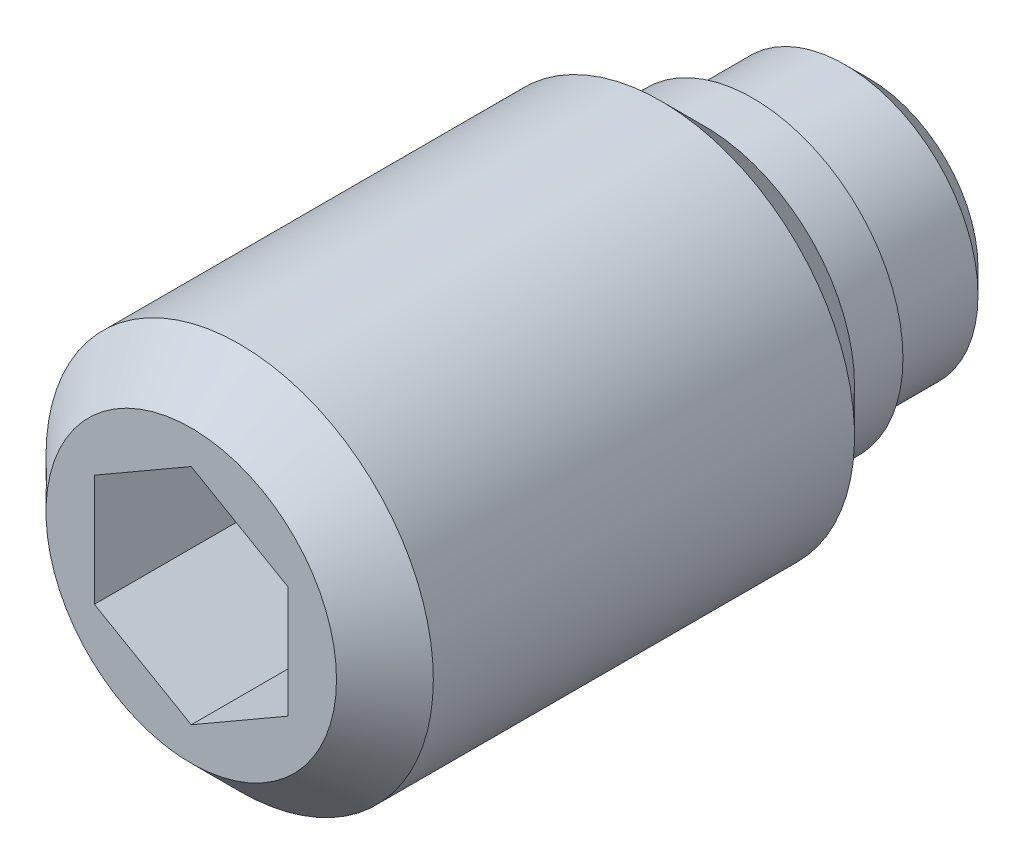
ISO-10303-21;
HEADER;
FILE_DESCRIPTION(('STEP AP214'),'2;1');
FILE_NAME('part.step','',(''),(''),'','','');
FILE_SCHEMA(('AUTOMOTIVE_DESIGN { 1 0 10303 214 1 1 1 1 }'));
ENDSEC;
DATA;
#1=APPLICATION_CONTEXT('core data for automotive mechanical design processes');
#2=APPLICATION_PROTOCOL_DEFINITION('international standard','automotive_design',2000,#1);
#3=PRODUCT_CONTEXT('',#1,'mechanical');
#4=PRODUCT('Part','Part','',(#3));
#5=PRODUCT_RELATED_PRODUCT_CATEGORY('part','',(#4));
#6=PRODUCT_DEFINITION_FORMATION('','',#4);
#7=PRODUCT_DEFINITION_CONTEXT('part definition',#1,'design');
#8=PRODUCT_DEFINITION('design','',#6,#7);
#9=PRODUCT_DEFINITION_SHAPE('','',#8);
#10=(LENGTH_UNIT() NAMED_UNIT(*) SI_UNIT(.MILLI.,.METRE.));
#11=(NAMED_UNIT(*) PLANE_ANGLE_UNIT() SI_UNIT($,.RADIAN.));
#12=(NAMED_UNIT(*) SI_UNIT($,.STERADIAN.) SOLID_ANGLE_UNIT());
#13=UNCERTAINTY_MEASURE_WITH_UNIT(LENGTH_MEASURE(1.E-05),#10,'distance_accuracy_value','');
#14=(GEOMETRIC_REPRESENTATION_CONTEXT(3) GLOBAL_UNCERTAINTY_ASSIGNED_CONTEXT((#13)) GLOBAL_UNIT_ASSIGNED_CONTEXT((#10,
#11,#12)) REPRESENTATION_CONTEXT('',''));
#15=CARTESIAN_POINT('',(0.,0.,0.));
#16=DIRECTION('',(0.,0.,1.));
#17=DIRECTION('',(1.,0.,0.));
#18=AXIS2_PLACEMENT_3D('',#15,#16,#17);
#19=CARTESIAN_POINT('',(0.,0.,2.4));
#20=DIRECTION('',(0.,0.,-1.));
#21=DIRECTION('',(-1.,0.,0.));
#22=AXIS2_PLACEMENT_3D('',#19,#20,#21);
#23=CYLINDRICAL_SURFACE('',#22,4.);
#24=CARTESIAN_POINT('',(0.,0.,13.));
#25=DIRECTION('',(0.,0.,1.));
#26=DIRECTION('',(1.,0.,0.));
#27=AXIS2_PLACEMENT_3D('',#24,#25,#26);
#28=CIRCLE('',#27,4.);
#29=CARTESIAN_POINT('',(4.,0.,13.));
#30=VERTEX_POINT('',#29);
#31=EDGE_CURVE('E9',#30,#30,#28,.F.);
#32=ORIENTED_EDGE('',*,*,#31,.T.);
#33=EDGE_LOOP('',(#32));
#34=FACE_BOUND('',#33,.T.);
#35=CARTESIAN_POINT('',(0.,0.,4.3));
#36=DIRECTION('',(0.,0.,-1.));
#37=DIRECTION('',(-1.,0.,0.));
#38=AXIS2_PLACEMENT_3D('',#35,#36,#37);
#39=CIRCLE('',#38,4.);
#40=CARTESIAN_POINT('',(-4.,0.,4.3));
#41=VERTEX_POINT('',#40);
#42=EDGE_CURVE('E136',#41,#41,#39,.T.);
#43=ORIENTED_EDGE('',*,*,#42,.F.);
#44=EDGE_LOOP('',(#43));
#45=FACE_BOUND('',#44,.T.);
#46=ADVANCED_FACE('F14',(#34,#45),#23,.T.);
#47=CARTESIAN_POINT('',(0.,0.,4.3));
#48=DIRECTION('',(0.,0.,1.));
#49=DIRECTION('',(1.,0.,0.));
#50=AXIS2_PLACEMENT_3D('',#47,#48,#49);
#51=CONICAL_SURFACE('',#50,4.,0.785398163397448);
#52=ORIENTED_EDGE('',*,*,#42,.T.);
#53=EDGE_LOOP('',(#52));
#54=FACE_BOUND('',#53,.T.);
#55=CARTESIAN_POINT('',(0.,0.,3.4));
#56=DIRECTION('',(0.,0.,-1.));
#57=DIRECTION('',(-1.,0.,0.));
#58=AXIS2_PLACEMENT_3D('',#55,#56,#57);
#59=CIRCLE('',#58,3.1);
#60=CARTESIAN_POINT('',(-3.1,0.,3.4));
#61=VERTEX_POINT('',#60);
#62=EDGE_CURVE('E133',#61,#61,#59,.T.);
#63=ORIENTED_EDGE('',*,*,#62,.F.);
#64=EDGE_LOOP('',(#63));
#65=FACE_BOUND('',#64,.T.);
#66=ADVANCED_FACE('F158',(#54,#65),#51,.T.);
#67=CARTESIAN_POINT('',(0.,0.,2.4));
#68=DIRECTION('',(0.,0.,-1.));
#69=DIRECTION('',(-1.,0.,0.));
#70=AXIS2_PLACEMENT_3D('',#67,#68,#69);
#71=CYLINDRICAL_SURFACE('',#70,3.1);
#72=ORIENTED_EDGE('',*,*,#62,.T.);
#73=EDGE_LOOP('',(#72));
#74=FACE_BOUND('',#73,.T.);
#75=CARTESIAN_POINT('',(0.,0.,2.4));
#76=DIRECTION('',(0.,0.,-1.));
#77=DIRECTION('',(-1.,0.,0.));
#78=AXIS2_PLACEMENT_3D('',#75,#76,#77);
#79=CIRCLE('',#78,3.1);
#80=CARTESIAN_POINT('',(-3.1,0.,2.4));
#81=VERTEX_POINT('',#80);
#82=EDGE_CURVE('E130',#81,#81,#79,.T.);
#83=ORIENTED_EDGE('',*,*,#82,.F.);
#84=EDGE_LOOP('',(#83));
#85=FACE_BOUND('',#84,.T.);
#86=ADVANCED_FACE('F163',(#74,#85),#71,.T.);
#87=CARTESIAN_POINT('',(0.,3.1,2.4));
#88=DIRECTION('',(0.,0.,1.));
#89=DIRECTION('',(1.,0.,0.));
#90=AXIS2_PLACEMENT_3D('',#87,#88,#89);
#91=PLANE('',#90);
#92=ORIENTED_EDGE('',*,*,#82,.T.);
#93=EDGE_LOOP('',(#92));
#94=FACE_BOUND('',#93,.T.);
#95=CARTESIAN_POINT('',(0.,0.,2.4));
#96=DIRECTION('',(0.,0.,-1.));
#97=DIRECTION('',(-1.,0.,0.));
#98=AXIS2_PLACEMENT_3D('',#95,#96,#97);
#99=CIRCLE('',#98,2.75);
#100=CARTESIAN_POINT('',(-2.75,0.,2.4));
#101=VERTEX_POINT('',#100);
#102=EDGE_CURVE('E127',#101,#101,#99,.T.);
#103=ORIENTED_EDGE('',*,*,#102,.F.);
#104=EDGE_LOOP('',(#103));
#105=FACE_BOUND('',#104,.T.);
#106=ADVANCED_FACE('F170',(#94,#105),#91,.F.);
#107=CARTESIAN_POINT('',(0.,0.,0.));
#108=DIRECTION('',(0.,0.,-1.));
#109=DIRECTION('',(-1.,0.,0.));
#110=AXIS2_PLACEMENT_3D('',#107,#108,#109);
#111=CYLINDRICAL_SURFACE('',#110,2.75);
#112=CARTESIAN_POINT('',(0.,0.,0.5));
#113=DIRECTION('',(0.,0.,-1.));
#114=DIRECTION('',(-1.,0.,0.));
#115=AXIS2_PLACEMENT_3D('',#112,#113,#114);
#116=CIRCLE('',#115,2.75);
#117=CARTESIAN_POINT('',(-2.75,0.,0.5));
#118=VERTEX_POINT('',#117);
#119=EDGE_CURVE('E124',#118,#118,#116,.T.);
#120=ORIENTED_EDGE('',*,*,#119,.F.);
#121=EDGE_LOOP('',(#120));
#122=FACE_BOUND('',#121,.T.);
#123=ORIENTED_EDGE('',*,*,#102,.T.);
#124=EDGE_LOOP('',(#123));
#125=FACE_BOUND('',#124,.T.);
#126=ADVANCED_FACE('F174',(#122,#125),#111,.T.);
#127=CARTESIAN_POINT('',(0.,0.,0.5));
#128=DIRECTION('',(0.,0.,1.));
#129=DIRECTION('',(1.,0.,0.));
#130=AXIS2_PLACEMENT_3D('',#127,#128,#129);
#131=CONICAL_SURFACE('',#130,2.75,0.785398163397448);
#132=CARTESIAN_POINT('',(0.,0.,0.));
#133=DIRECTION('',(0.,0.,-1.));
#134=DIRECTION('',(-1.,0.,0.));
#135=AXIS2_PLACEMENT_3D('',#132,#133,#134);
#136=CIRCLE('',#135,2.25);
#137=CARTESIAN_POINT('',(-2.25,0.,0.));
#138=VERTEX_POINT('',#137);
#139=EDGE_CURVE('E116',#138,#138,#136,.T.);
#140=ORIENTED_EDGE('',*,*,#139,.F.);
#141=EDGE_LOOP('',(#140));
#142=FACE_BOUND('',#141,.T.);
#143=ORIENTED_EDGE('',*,*,#119,.T.);
#144=EDGE_LOOP('',(#143));
#145=FACE_BOUND('',#144,.T.);
#146=ADVANCED_FACE('F178',(#142,#145),#131,.T.);
#147=CARTESIAN_POINT('',(0.,2.25,0.));
#148=DIRECTION('',(0.,0.,1.));
#149=DIRECTION('',(1.,0.,0.));
#150=AXIS2_PLACEMENT_3D('',#147,#148,#149);
#151=PLANE('',#150);
#152=ORIENTED_EDGE('',*,*,#139,.T.);
#153=EDGE_LOOP('',(#152));
#154=FACE_BOUND('',#153,.T.);
#155=ADVANCED_FACE('F153',(#154),#151,.F.);
#156=CARTESIAN_POINT('',(0.,0.,14.));
#157=DIRECTION('',(0.,0.,1.));
#158=DIRECTION('',(1.,0.,0.));
#159=AXIS2_PLACEMENT_3D('',#156,#157,#158);
#160=PLANE('',#159);
#161=DIRECTION('',(0.866025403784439,-0.5,0.));
#162=VECTOR('',#161,1.);
#163=CARTESIAN_POINT('',(-2.,-1.15470053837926,14.));
#164=LINE('',#163,#162);
#165=CARTESIAN_POINT('',(-2.,-1.15470053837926,14.));
#166=VERTEX_POINT('',#165);
#167=CARTESIAN_POINT('',(0.,-2.30940107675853,14.));
#168=VERTEX_POINT('',#167);
#169=EDGE_CURVE('E29',#166,#168,#164,.T.);
#170=ORIENTED_EDGE('',*,*,#169,.F.);
#171=DIRECTION('',(0.,-1.,0.));
#172=VECTOR('',#171,1.);
#173=CARTESIAN_POINT('',(-2.,1.15470053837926,14.));
#174=LINE('',#173,#172);
#175=CARTESIAN_POINT('',(-2.,1.15470053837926,14.));
#176=VERTEX_POINT('',#175);
#177=EDGE_CURVE('E112',#176,#166,#174,.T.);
#178=ORIENTED_EDGE('',*,*,#177,.F.);
#179=DIRECTION('',(-0.866025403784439,-0.5,0.));
#180=VECTOR('',#179,1.);
#181=CARTESIAN_POINT('',(0.,2.30940107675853,14.));
#182=LINE('',#181,#180);
#183=CARTESIAN_POINT('',(0.,2.30940107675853,14.));
#184=VERTEX_POINT('',#183);
#185=EDGE_CURVE('E110',#184,#176,#182,.T.);
#186=ORIENTED_EDGE('',*,*,#185,.F.);
#187=DIRECTION('',(-0.866025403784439,0.5,0.));
#188=VECTOR('',#187,1.);
#189=CARTESIAN_POINT('',(2.,1.15470053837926,14.));
#190=LINE('',#189,#188);
#191=CARTESIAN_POINT('',(2.,1.15470053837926,14.));
#192=VERTEX_POINT('',#191);
#193=EDGE_CURVE('E77',#192,#184,#190,.T.);
#194=ORIENTED_EDGE('',*,*,#193,.F.);
#195=DIRECTION('',(0.,1.,0.));
#196=VECTOR('',#195,1.);
#197=CARTESIAN_POINT('',(2.,-1.15470053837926,14.));
#198=LINE('',#197,#196);
#199=CARTESIAN_POINT('',(2.,-1.15470053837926,14.));
#200=VERTEX_POINT('',#199);
#201=EDGE_CURVE('E106',#200,#192,#198,.T.);
#202=ORIENTED_EDGE('',*,*,#201,.F.);
#203=DIRECTION('',(0.866025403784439,0.5,0.));
#204=VECTOR('',#203,1.);
#205=CARTESIAN_POINT('',(0.,-2.30940107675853,14.));
#206=LINE('',#205,#204);
#207=EDGE_CURVE('E103',#168,#200,#206,.T.);
#208=ORIENTED_EDGE('',*,*,#207,.F.);
#209=EDGE_LOOP('',(#170,#178,#186,#194,#202,#208));
#210=FACE_BOUND('',#209,.T.);
#211=CARTESIAN_POINT('',(0.,0.,14.));
#212=DIRECTION('',(0.,0.,1.));
#213=DIRECTION('',(1.,0.,0.));
#214=AXIS2_PLACEMENT_3D('',#211,#212,#213);
#215=CIRCLE('',#214,3.);
#216=CARTESIAN_POINT('',(3.,0.,14.));
#217=VERTEX_POINT('',#216);
#218=EDGE_CURVE('E22',#217,#217,#215,.T.);
#219=ORIENTED_EDGE('',*,*,#218,.T.);
#220=EDGE_LOOP('',(#219));
#221=FACE_BOUND('',#220,.T.);
#222=ADVANCED_FACE('F141',(#210,#221),#160,.T.);
#223=CARTESIAN_POINT('',(0.,0.,14.));
#224=DIRECTION('',(0.,0.,-1.));
#225=DIRECTION('',(-1.,0.,0.));
#226=AXIS2_PLACEMENT_3D('',#223,#224,#225);
#227=CONICAL_SURFACE('',#226,3.,0.785398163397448);
#228=ORIENTED_EDGE('',*,*,#31,.F.);
#229=EDGE_LOOP('',(#228));
#230=FACE_BOUND('',#229,.T.);
#231=ORIENTED_EDGE('',*,*,#218,.F.);
#232=EDGE_LOOP('',(#231));
#233=FACE_BOUND('',#232,.T.);
#234=ADVANCED_FACE('F16',(#230,#233),#227,.T.);
#235=CARTESIAN_POINT('',(-2.,-1.15470053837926,11.));
#236=DIRECTION('',(-0.5,-0.866025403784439,0.));
#237=DIRECTION('',(0.866025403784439,-0.5,0.));
#238=AXIS2_PLACEMENT_3D('',#235,#236,#237);
#239=PLANE('',#238);
#240=ORIENTED_EDGE('',*,*,#169,.T.);
#241=DIRECTION('',(0.,0.,1.));
#242=VECTOR('',#241,1.);
#243=CARTESIAN_POINT('',(0.,-2.30940107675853,11.));
#244=LINE('',#243,#242);
#245=CARTESIAN_POINT('',(0.,-2.30940107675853,11.));
#246=VERTEX_POINT('',#245);
#247=EDGE_CURVE('E59',#246,#168,#244,.T.);
#248=ORIENTED_EDGE('',*,*,#247,.F.);
#249=DIRECTION('',(0.866025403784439,-0.5,0.));
#250=VECTOR('',#249,1.);
#251=CARTESIAN_POINT('',(-2.,-1.15470053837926,11.));
#252=LINE('',#251,#250);
#253=CARTESIAN_POINT('',(-2.,-1.15470053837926,11.));
#254=VERTEX_POINT('',#253);
#255=EDGE_CURVE('E114',#254,#246,#252,.T.);
#256=ORIENTED_EDGE('',*,*,#255,.F.);
#257=DIRECTION('',(0.,0.,1.));
#258=VECTOR('',#257,1.);
#259=CARTESIAN_POINT('',(-2.,-1.15470053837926,11.));
#260=LINE('',#259,#258);
#261=EDGE_CURVE('E37',#254,#166,#260,.T.);
#262=ORIENTED_EDGE('',*,*,#261,.T.);
#263=EDGE_LOOP('',(#240,#248,#256,#262));
#264=FACE_BOUND('',#263,.T.);
#265=ADVANCED_FACE('F144',(#264),#239,.F.);
#266=CARTESIAN_POINT('',(-2.,1.15470053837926,11.));
#267=DIRECTION('',(-1.,0.,0.));
#268=DIRECTION('',(0.,0.,1.));
#269=AXIS2_PLACEMENT_3D('',#266,#267,#268);
#270=PLANE('',#269);
#271=ORIENTED_EDGE('',*,*,#177,.T.);
#272=ORIENTED_EDGE('',*,*,#261,.F.);
#273=DIRECTION('',(0.,-1.,0.));
#274=VECTOR('',#273,1.);
#275=CARTESIAN_POINT('',(-2.,1.15470053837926,11.));
#276=LINE('',#275,#274);
#277=CARTESIAN_POINT('',(-2.,1.15470053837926,11.));
#278=VERTEX_POINT('',#277);
#279=EDGE_CURVE('E89',#278,#254,#276,.T.);
#280=ORIENTED_EDGE('',*,*,#279,.F.);
#281=DIRECTION('',(0.,0.,1.));
#282=VECTOR('',#281,1.);
#283=CARTESIAN_POINT('',(-2.,1.15470053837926,11.));
#284=LINE('',#283,#282);
#285=EDGE_CURVE('E81',#278,#176,#284,.T.);
#286=ORIENTED_EDGE('',*,*,#285,.T.);
#287=EDGE_LOOP('',(#271,#272,#280,#286));
#288=FACE_BOUND('',#287,.T.);
#289=ADVANCED_FACE('F151',(#288),#270,.F.);
#290=CARTESIAN_POINT('',(0.,2.30940107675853,11.));
#291=DIRECTION('',(-0.5,0.866025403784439,0.));
#292=DIRECTION('',(-0.866025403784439,-0.5,0.));
#293=AXIS2_PLACEMENT_3D('',#290,#291,#292);
#294=PLANE('',#293);
#295=ORIENTED_EDGE('',*,*,#185,.T.);
#296=ORIENTED_EDGE('',*,*,#285,.F.);
#297=DIRECTION('',(-0.866025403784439,-0.5,0.));
#298=VECTOR('',#297,1.);
#299=CARTESIAN_POINT('',(0.,2.30940107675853,11.));
#300=LINE('',#299,#298);
#301=CARTESIAN_POINT('',(0.,2.30940107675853,11.));
#302=VERTEX_POINT('',#301);
#303=EDGE_CURVE('E85',#302,#278,#300,.T.);
#304=ORIENTED_EDGE('',*,*,#303,.F.);
#305=DIRECTION('',(0.,0.,1.));
#306=VECTOR('',#305,1.);
#307=CARTESIAN_POINT('',(0.,2.30940107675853,11.));
#308=LINE('',#307,#306);
#309=EDGE_CURVE('E70',#302,#184,#308,.T.);
#310=ORIENTED_EDGE('',*,*,#309,.T.);
#311=EDGE_LOOP('',(#295,#296,#304,#310));
#312=FACE_BOUND('',#311,.T.);
#313=ADVANCED_FACE('F86',(#312),#294,.F.);
#314=CARTESIAN_POINT('',(2.,1.15470053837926,11.));
#315=DIRECTION('',(0.5,0.866025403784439,0.));
#316=DIRECTION('',(-0.866025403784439,0.5,0.));
#317=AXIS2_PLACEMENT_3D('',#314,#315,#316);
#318=PLANE('',#317);
#319=ORIENTED_EDGE('',*,*,#193,.T.);
#320=ORIENTED_EDGE('',*,*,#309,.F.);
#321=DIRECTION('',(-0.866025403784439,0.5,0.));
#322=VECTOR('',#321,1.);
#323=CARTESIAN_POINT('',(2.,1.15470053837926,11.));
#324=LINE('',#323,#322);
#325=CARTESIAN_POINT('',(2.,1.15470053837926,11.));
#326=VERTEX_POINT('',#325);
#327=EDGE_CURVE('E74',#326,#302,#324,.T.);
#328=ORIENTED_EDGE('',*,*,#327,.F.);
#329=DIRECTION('',(0.,0.,1.));
#330=VECTOR('',#329,1.);
#331=CARTESIAN_POINT('',(2.,1.15470053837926,11.));
#332=LINE('',#331,#330);
#333=EDGE_CURVE('E82',#326,#192,#332,.T.);
#334=ORIENTED_EDGE('',*,*,#333,.T.);
#335=EDGE_LOOP('',(#319,#320,#328,#334));
#336=FACE_BOUND('',#335,.T.);
#337=ADVANCED_FACE('F72',(#336),#318,.F.);
#338=CARTESIAN_POINT('',(2.,-1.15470053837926,11.));
#339=DIRECTION('',(1.,0.,0.));
#340=DIRECTION('',(0.,0.,-1.));
#341=AXIS2_PLACEMENT_3D('',#338,#339,#340);
#342=PLANE('',#341);
#343=ORIENTED_EDGE('',*,*,#201,.T.);
#344=ORIENTED_EDGE('',*,*,#333,.F.);
#345=DIRECTION('',(0.,1.,0.));
#346=VECTOR('',#345,1.);
#347=CARTESIAN_POINT('',(2.,-1.15470053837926,11.));
#348=LINE('',#347,#346);
#349=CARTESIAN_POINT('',(2.,-1.15470053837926,11.));
#350=VERTEX_POINT('',#349);
#351=EDGE_CURVE('E95',#350,#326,#348,.T.);
#352=ORIENTED_EDGE('',*,*,#351,.F.);
#353=DIRECTION('',(0.,0.,1.));
#354=VECTOR('',#353,1.);
#355=CARTESIAN_POINT('',(2.,-1.15470053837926,11.));
#356=LINE('',#355,#354);
#357=EDGE_CURVE('E119',#350,#200,#356,.T.);
#358=ORIENTED_EDGE('',*,*,#357,.T.);
#359=EDGE_LOOP('',(#343,#344,#352,#358));
#360=FACE_BOUND('',#359,.T.);
#361=ADVANCED_FACE('F189',(#360),#342,.F.);
#362=CARTESIAN_POINT('',(0.,-2.30940107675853,11.));
#363=DIRECTION('',(0.5,-0.866025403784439,0.));
#364=DIRECTION('',(0.866025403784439,0.5,0.));
#365=AXIS2_PLACEMENT_3D('',#362,#363,#364);
#366=PLANE('',#365);
#367=ORIENTED_EDGE('',*,*,#207,.T.);
#368=ORIENTED_EDGE('',*,*,#357,.F.);
#369=DIRECTION('',(0.866025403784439,0.5,0.));
#370=VECTOR('',#369,1.);
#371=CARTESIAN_POINT('',(0.,-2.30940107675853,11.));
#372=LINE('',#371,#370);
#373=EDGE_CURVE('E97',#246,#350,#372,.T.);
#374=ORIENTED_EDGE('',*,*,#373,.F.);
#375=ORIENTED_EDGE('',*,*,#247,.T.);
#376=EDGE_LOOP('',(#367,#368,#374,#375));
#377=FACE_BOUND('',#376,.T.);
#378=ADVANCED_FACE('F186',(#377),#366,.F.);
#379=CARTESIAN_POINT('',(0.,0.,11.));
#380=DIRECTION('',(0.,0.,1.));
#381=DIRECTION('',(1.,0.,0.));
#382=AXIS2_PLACEMENT_3D('',#379,#380,#381);
#383=PLANE('',#382);
#384=ORIENTED_EDGE('',*,*,#255,.T.);
#385=ORIENTED_EDGE('',*,*,#373,.T.);
#386=ORIENTED_EDGE('',*,*,#351,.T.);
#387=ORIENTED_EDGE('',*,*,#327,.T.);
#388=ORIENTED_EDGE('',*,*,#303,.T.);
#389=ORIENTED_EDGE('',*,*,#279,.T.);
#390=EDGE_LOOP('',(#384,#385,#386,#387,#388,#389));
#391=FACE_BOUND('',#390,.T.);
#392=ADVANCED_FACE('F92',(#391),#383,.T.);
#393=CLOSED_SHELL('',(#46,#66,#86,#106,#126,#146,#155,#222,#234,#265,#289,#313,#337,#361,#378,#392));
#394=MANIFOLD_SOLID_BREP('B1',#393);
#395=ADVANCED_BREP_SHAPE_REPRESENTATION('',(#18,#394),#14);
#396=SHAPE_DEFINITION_REPRESENTATION(#9,#395);
ENDSEC;
END-ISO-10303-21;
